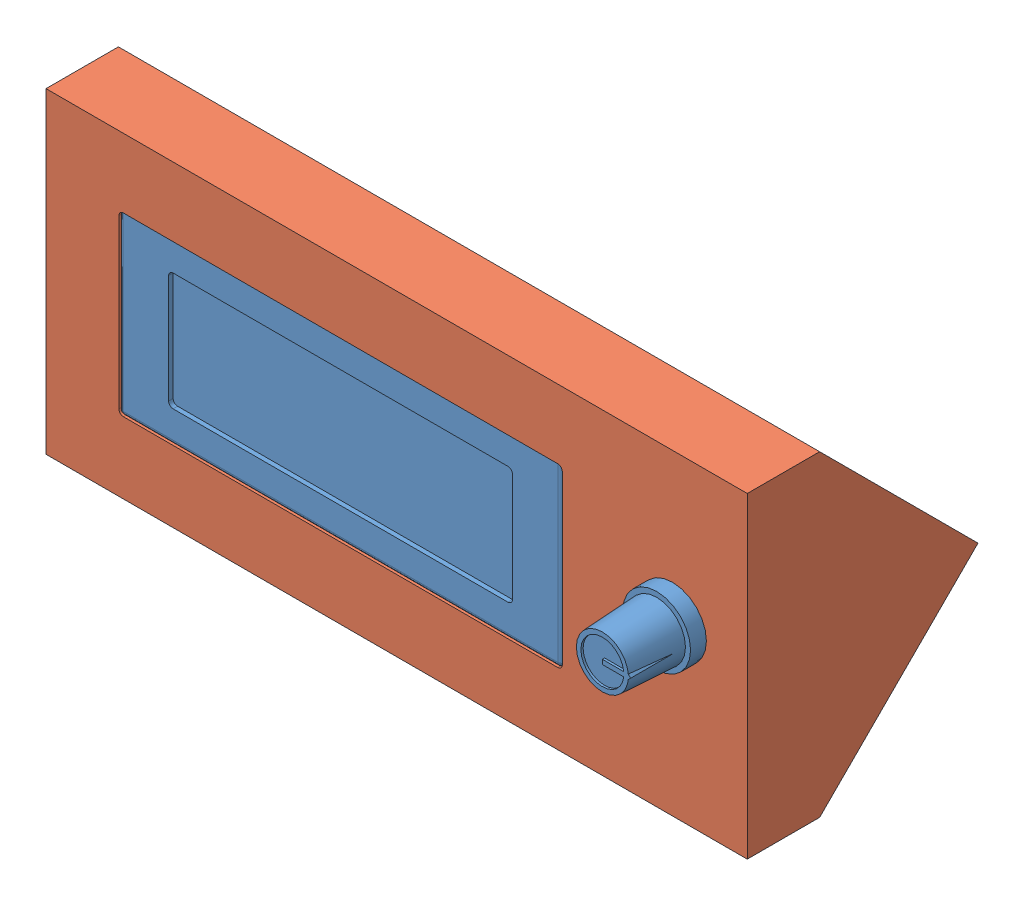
SolidWorks assembly LCD_WITH_BOX.SLDASM, configuration Standard (file format 8000). Lengths in mm.
Overall size (155 70 68).
2 component instances, 2 part files, 3 mates.
Components (placement in the parent):
- RAMPS LCD2004-1: RAMPS LCD2004.SLDPRT [Standard] at (-17.3663 0.0028 150) size (150 62.75 33)
- LCD_Box-1: LCD_Box.SLDPRT [Standard] at (2.6946 -5.7966 163.5) x (1 0 0) z (0 -1 0) size (155 51 70)
Mates (geometry in assembly coordinates):
- Deckungsgleich1: coincident aligned: plane of RAMPS LCD2004-1 through (-17.3663 0.0028 166) normal (0 0 1); plane of LCD_Box-1 through (2.6946 -5.7966 166) normal (0 0 1)
- Deckungsgleich2: coincident anti-aligned: plane of RAMPS LCD2004-1 through (19.2837 14.7528 166) normal (1 0 0); plane of LCD_Box-1 through (19.2837 12.7528 163.5) normal (-1 0 0)
- Deckungsgleich3: coincident anti-aligned: plane of RAMPS LCD2004-1 through (-78.7663 -25.2472 166) normal (0 -1 0); plane of LCD_Box-1 through (-77.7163 -25.2472 163.5) normal (0 1 0)
